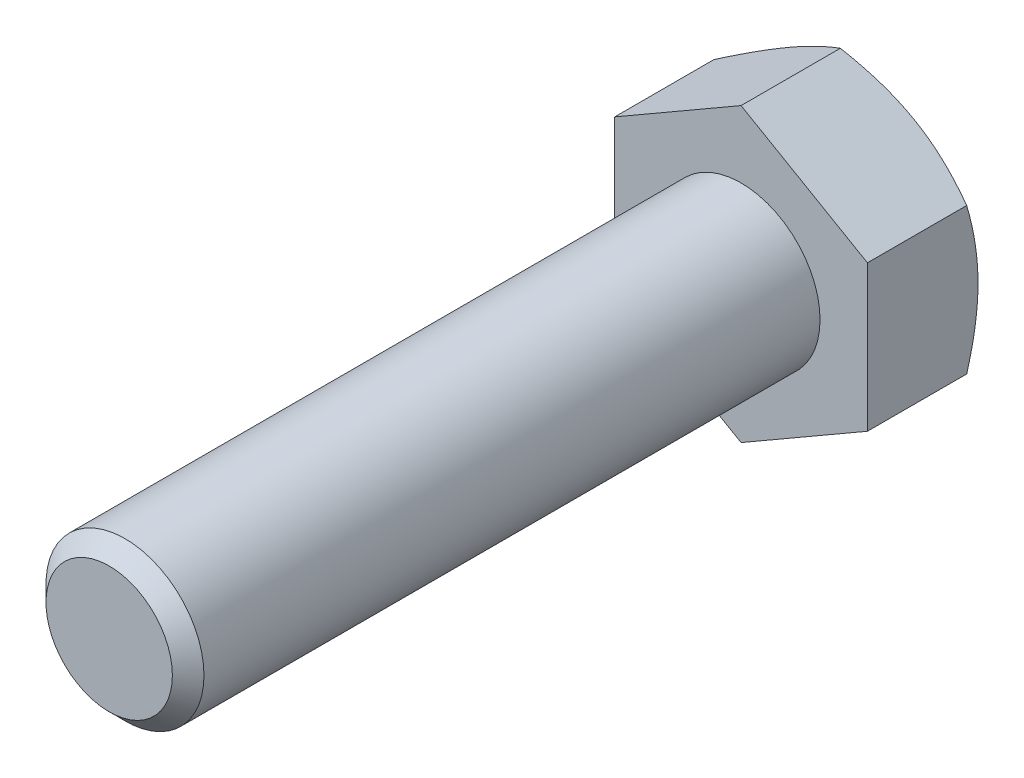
ISO-10303-21;
HEADER;
FILE_DESCRIPTION(('STEP AP214'),'2;1');
FILE_NAME('part.step','',(''),(''),'','','');
FILE_SCHEMA(('AUTOMOTIVE_DESIGN { 1 0 10303 214 1 1 1 1 }'));
ENDSEC;
DATA;
#1=APPLICATION_CONTEXT('core data for automotive mechanical design processes');
#2=APPLICATION_PROTOCOL_DEFINITION('international standard','automotive_design',2000,#1);
#3=PRODUCT_CONTEXT('',#1,'mechanical');
#4=PRODUCT('Part','Part','',(#3));
#5=PRODUCT_RELATED_PRODUCT_CATEGORY('part','',(#4));
#6=PRODUCT_DEFINITION_FORMATION('','',#4);
#7=PRODUCT_DEFINITION_CONTEXT('part definition',#1,'design');
#8=PRODUCT_DEFINITION('design','',#6,#7);
#9=PRODUCT_DEFINITION_SHAPE('','',#8);
#10=(LENGTH_UNIT() NAMED_UNIT(*) SI_UNIT(.MILLI.,.METRE.));
#11=(NAMED_UNIT(*) PLANE_ANGLE_UNIT() SI_UNIT($,.RADIAN.));
#12=(NAMED_UNIT(*) SI_UNIT($,.STERADIAN.) SOLID_ANGLE_UNIT());
#13=UNCERTAINTY_MEASURE_WITH_UNIT(LENGTH_MEASURE(1.E-05),#10,'distance_accuracy_value','');
#14=(GEOMETRIC_REPRESENTATION_CONTEXT(3) GLOBAL_UNCERTAINTY_ASSIGNED_CONTEXT((#13)) GLOBAL_UNIT_ASSIGNED_CONTEXT((#10,
#11,#12)) REPRESENTATION_CONTEXT('',''));
#15=CARTESIAN_POINT('',(0.,0.,0.));
#16=DIRECTION('',(0.,0.,1.));
#17=DIRECTION('',(1.,0.,0.));
#18=AXIS2_PLACEMENT_3D('',#15,#16,#17);
#19=CARTESIAN_POINT('',(0.,0.,20.));
#20=DIRECTION('',(0.,0.,0.999999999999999));
#21=DIRECTION('',(1.,0.,0.));
#22=AXIS2_PLACEMENT_3D('',#19,#20,#21);
#23=PLANE('',#22);
#24=CARTESIAN_POINT('',(0.,0.,20.));
#25=DIRECTION('',(0.,0.,0.999999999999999));
#26=DIRECTION('',(1.,0.,0.));
#27=AXIS2_PLACEMENT_3D('',#24,#25,#26);
#28=CIRCLE('',#27,2.);
#29=CARTESIAN_POINT('',(2.,0.,20.));
#30=VERTEX_POINT('',#29);
#31=EDGE_CURVE('E198',#30,#30,#28,.T.);
#32=ORIENTED_EDGE('',*,*,#31,.T.);
#33=EDGE_LOOP('',(#32));
#34=FACE_BOUND('',#33,.T.);
#35=ADVANCED_FACE('F24',(#34),#23,.T.);
#36=CARTESIAN_POINT('',(0.,0.,0.));
#37=DIRECTION('',(0.,0.,0.999999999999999));
#38=DIRECTION('',(1.,0.,0.));
#39=AXIS2_PLACEMENT_3D('',#36,#37,#38);
#40=CYLINDRICAL_SURFACE('',#39,2.5);
#41=CARTESIAN_POINT('',(0.,0.,19.5));
#42=DIRECTION('',(0.,0.,0.999999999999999));
#43=DIRECTION('',(1.,0.,0.));
#44=AXIS2_PLACEMENT_3D('',#41,#42,#43);
#45=CIRCLE('',#44,2.5);
#46=CARTESIAN_POINT('',(2.50000000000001,0.,19.5));
#47=VERTEX_POINT('',#46);
#48=EDGE_CURVE('E200',#47,#47,#45,.F.);
#49=CARTESIAN_POINT('',(0.,0.,0.));
#50=DIRECTION('',(0.,0.,0.999999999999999));
#51=DIRECTION('',(1.,0.,0.));
#52=AXIS2_PLACEMENT_3D('',#49,#50,#51);
#53=CIRCLE('',#52,2.5);
#54=CARTESIAN_POINT('',(2.5,0.,0.));
#55=VERTEX_POINT('',#54);
#56=EDGE_CURVE('E201',#55,#55,#53,.F.);
#57=CARTESIAN_POINT('',(2.50000000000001,0.,19.5));
#58=CARTESIAN_POINT('',(2.50000000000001,0.,19.296875));
#59=CARTESIAN_POINT('',(2.50000000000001,0.,19.09375));
#60=CARTESIAN_POINT('',(2.50000000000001,0.,18.6875));
#61=CARTESIAN_POINT('',(2.50000000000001,0.,18.484375));
#62=CARTESIAN_POINT('',(2.50000000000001,0.,18.078125));
#63=CARTESIAN_POINT('',(2.50000000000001,0.,17.875));
#64=CARTESIAN_POINT('',(2.50000000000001,0.,17.46875));
#65=CARTESIAN_POINT('',(2.50000000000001,0.,17.265625));
#66=CARTESIAN_POINT('',(2.50000000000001,0.,16.859375));
#67=CARTESIAN_POINT('',(2.50000000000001,0.,16.65625));
#68=CARTESIAN_POINT('',(2.50000000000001,0.,16.25));
#69=CARTESIAN_POINT('',(2.50000000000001,0.,16.046875));
#70=CARTESIAN_POINT('',(2.50000000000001,0.,15.640625));
#71=CARTESIAN_POINT('',(2.50000000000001,0.,15.4375));
#72=CARTESIAN_POINT('',(2.50000000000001,0.,15.03125));
#73=CARTESIAN_POINT('',(2.50000000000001,0.,14.828125));
#74=CARTESIAN_POINT('',(2.50000000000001,0.,14.421875));
#75=CARTESIAN_POINT('',(2.50000000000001,0.,14.21875));
#76=CARTESIAN_POINT('',(2.50000000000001,0.,13.8125));
#77=CARTESIAN_POINT('',(2.50000000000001,0.,13.609375));
#78=CARTESIAN_POINT('',(2.50000000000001,0.,13.203125));
#79=CARTESIAN_POINT('',(2.50000000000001,0.,13.));
#80=CARTESIAN_POINT('',(2.50000000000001,0.,12.59375));
#81=CARTESIAN_POINT('',(2.50000000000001,0.,12.390625));
#82=CARTESIAN_POINT('',(2.50000000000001,0.,11.984375));
#83=CARTESIAN_POINT('',(2.50000000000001,0.,11.78125));
#84=CARTESIAN_POINT('',(2.50000000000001,0.,11.375));
#85=CARTESIAN_POINT('',(2.50000000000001,0.,11.171875));
#86=CARTESIAN_POINT('',(2.50000000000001,0.,10.765625));
#87=CARTESIAN_POINT('',(2.50000000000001,0.,10.5625));
#88=CARTESIAN_POINT('',(2.50000000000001,0.,10.15625));
#89=CARTESIAN_POINT('',(2.50000000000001,0.,9.95312499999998));
#90=CARTESIAN_POINT('',(2.50000000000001,0.,9.54687499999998));
#91=CARTESIAN_POINT('',(2.50000000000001,0.,9.34374999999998));
#92=CARTESIAN_POINT('',(2.50000000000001,0.,8.93749999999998));
#93=CARTESIAN_POINT('',(2.5,0.,8.73437499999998));
#94=CARTESIAN_POINT('',(2.5,0.,8.32812499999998));
#95=CARTESIAN_POINT('',(2.5,0.,8.12499999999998));
#96=CARTESIAN_POINT('',(2.5,0.,7.71874999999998));
#97=CARTESIAN_POINT('',(2.5,0.,7.51562499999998));
#98=CARTESIAN_POINT('',(2.5,0.,7.10937499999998));
#99=CARTESIAN_POINT('',(2.5,0.,6.90624999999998));
#100=CARTESIAN_POINT('',(2.5,0.,6.49999999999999));
#101=CARTESIAN_POINT('',(2.5,0.,6.29687499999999));
#102=CARTESIAN_POINT('',(2.5,0.,5.89062499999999));
#103=CARTESIAN_POINT('',(2.5,0.,5.68749999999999));
#104=CARTESIAN_POINT('',(2.5,0.,5.28124999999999));
#105=CARTESIAN_POINT('',(2.5,0.,5.07812499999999));
#106=CARTESIAN_POINT('',(2.5,0.,4.67187499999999));
#107=CARTESIAN_POINT('',(2.5,0.,4.46874999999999));
#108=CARTESIAN_POINT('',(2.5,0.,4.06249999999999));
#109=CARTESIAN_POINT('',(2.5,0.,3.85937499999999));
#110=CARTESIAN_POINT('',(2.5,0.,3.45312499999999));
#111=CARTESIAN_POINT('',(2.5,0.,3.24999999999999));
#112=CARTESIAN_POINT('',(2.5,0.,2.84374999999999));
#113=CARTESIAN_POINT('',(2.5,0.,2.64062499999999));
#114=CARTESIAN_POINT('',(2.5,0.,2.234375));
#115=CARTESIAN_POINT('',(2.5,0.,2.03125));
#116=CARTESIAN_POINT('',(2.5,0.,1.625));
#117=CARTESIAN_POINT('',(2.5,0.,1.421875));
#118=CARTESIAN_POINT('',(2.5,0.,1.015625));
#119=CARTESIAN_POINT('',(2.5,0.,0.812499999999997));
#120=CARTESIAN_POINT('',(2.5,0.,0.406249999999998));
#121=CARTESIAN_POINT('',(2.5,0.,0.203124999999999));
#122=CARTESIAN_POINT('',(2.5,0.,0.));
#123=B_SPLINE_CURVE_WITH_KNOTS('',3,(#57,#58,#59,#60,#61,#62,#63,#64,#65,#66,#67,#68,#69,#70,
#71,#72,#73,#74,#75,#76,#77,#78,#79,#80,#81,#82,#83,#84,#85,#86,#87,#88,#89,#90,#91,#92,#93,#94,
#95,#96,#97,#98,#99,#100,#101,#102,#103,#104,#105,#106,#107,#108,#109,#110,#111,#112,#113,#114,
#115,#116,#117,#118,#119,#120,#121,#122),.UNSPECIFIED.,.F.,.F.,(4,2,2,2,2,2,2,2,2,2,2,2,2,2,2,2,
2,2,2,2,2,2,2,2,2,2,2,2,2,2,2,2,4),(0.,0.609374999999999,1.21874999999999,1.828125,2.4375,
3.04687499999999,3.65624999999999,4.26562499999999,4.87499999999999,5.48437499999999,
6.09374999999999,6.70312499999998,7.31249999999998,7.92187499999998,8.53124999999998,
9.14062499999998,9.74999999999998,10.359375,10.96875,11.578125,12.1875,12.796875,13.40625,
14.015625,14.625,15.234375,15.84375,16.453125,17.0625,17.671875,18.28125,18.890625,19.5),.UNSPECIFIED.);
#124=EDGE_CURVE('BSEAM189',#47,#55,#123,.T.);
#125=ORIENTED_EDGE('',*,*,#48,.T.);
#126=ORIENTED_EDGE('',*,*,#56,.F.);
#127=ORIENTED_EDGE('',*,*,#124,.T.);
#128=ORIENTED_EDGE('',*,*,#124,.F.);
#129=EDGE_LOOP('',(#125,#127,#126,#128));
#130=FACE_BOUND('',#129,.T.);
#131=ADVANCED_FACE('F189',(#130),#40,.T.);
#132=CARTESIAN_POINT('',(0.,0.,20.));
#133=DIRECTION('',(0.,0.,-0.999999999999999));
#134=DIRECTION('',(-1.,0.,0.));
#135=AXIS2_PLACEMENT_3D('',#132,#133,#134);
#136=CONICAL_SURFACE('',#135,2.,0.785398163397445);
#137=ORIENTED_EDGE('',*,*,#48,.F.);
#138=EDGE_LOOP('',(#137));
#139=FACE_BOUND('',#138,.T.);
#140=ORIENTED_EDGE('',*,*,#31,.F.);
#141=EDGE_LOOP('',(#140));
#142=FACE_BOUND('',#141,.T.);
#143=ADVANCED_FACE('F194',(#139,#142),#136,.T.);
#144=CARTESIAN_POINT('',(0.,4.61880215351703,-3.5));
#145=DIRECTION('',(0.499999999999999,0.866025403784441,0.));
#146=DIRECTION('',(-0.866025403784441,0.499999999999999,0.));
#147=AXIS2_PLACEMENT_3D('',#144,#145,#146);
#148=PLANE('',#147);
#149=CARTESIAN_POINT('',(-0.000200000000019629,4.61891762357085,-3.14266774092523));
#150=CARTESIAN_POINT('',(0.175579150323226,4.51743148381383,-3.2012821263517));
#151=CARTESIAN_POINT('',(0.352875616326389,4.41506932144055,-3.25458967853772));
#152=CARTESIAN_POINT('',(0.710538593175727,4.20857250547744,-3.34763832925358));
#153=CARTESIAN_POINT('',(0.890911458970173,4.10443418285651,-3.38734651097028));
#154=CARTESIAN_POINT('',(1.24942181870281,3.89744813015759,-3.4491577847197));
#155=CARTESIAN_POINT('',(1.42750415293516,3.79463224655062,-3.47167226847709));
#156=CARTESIAN_POINT('',(1.78450671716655,3.58851671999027,-3.4985493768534));
#157=CARTESIAN_POINT('',(1.96342564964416,3.48521782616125,-3.50293425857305));
#158=CARTESIAN_POINT('',(2.29774284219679,3.29219970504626,-3.49380992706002));
#159=CARTESIAN_POINT('',(2.45319115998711,3.20245157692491,-3.48254104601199));
#160=CARTESIAN_POINT('',(2.76307505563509,3.02354002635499,-3.44682600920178));
#161=CARTESIAN_POINT('',(2.91750956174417,2.93437722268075,-3.42236765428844));
#162=CARTESIAN_POINT('',(3.22803232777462,2.75509682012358,-3.36122393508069));
#163=CARTESIAN_POINT('',(3.38408128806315,2.66500191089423,-3.32427939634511));
#164=CARTESIAN_POINT('',(3.69385183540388,2.48615580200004,-3.24042992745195));
#165=CARTESIAN_POINT('',(3.84757739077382,2.39740231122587,-3.19354469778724));
#166=CARTESIAN_POINT('',(4.00020000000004,2.30928560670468,-3.14266774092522));
#167=B_SPLINE_CURVE_WITH_KNOTS('',3,(#149,#150,#151,#152,#153,#154,#155,#156,#157,#158,#159,
#160,#161,#162,#163,#164,#165,#166),.UNSPECIFIED.,.F.,.F.,(4,2,2,2,2,2,2,2,4),(0.,
0.634047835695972,1.26961969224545,1.88946157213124,2.508542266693,3.04757825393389,
3.58711366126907,4.13861653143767,4.68903648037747),.UNSPECIFIED.);
#168=CARTESIAN_POINT('',(0.,4.61880215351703,-3.14273441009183));
#169=VERTEX_POINT('',#168);
#170=CARTESIAN_POINT('',(2.00000000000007,3.46410161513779,-3.49999999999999));
#171=VERTEX_POINT('',#170);
#172=EDGE_CURVE('E234',#169,#171,#167,.T.);
#173=ORIENTED_EDGE('',*,*,#172,.F.);
#174=DIRECTION('',(0.,0.,0.999999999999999));
#175=VECTOR('',#174,1.);
#176=CARTESIAN_POINT('',(0.,4.61880215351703,-3.5));
#177=LINE('',#176,#175);
#178=CARTESIAN_POINT('',(0.,4.61880215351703,0.));
#179=VERTEX_POINT('',#178);
#180=EDGE_CURVE('E208',#169,#179,#177,.T.);
#181=ORIENTED_EDGE('',*,*,#180,.T.);
#182=DIRECTION('',(-0.86602540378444,0.499999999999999,0.));
#183=VECTOR('',#182,1.);
#184=CARTESIAN_POINT('',(0.,4.61880215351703,0.));
#185=LINE('',#184,#183);
#186=CARTESIAN_POINT('',(4.,2.30940107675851,0.));
#187=VERTEX_POINT('',#186);
#188=EDGE_CURVE('E232',#187,#179,#185,.T.);
#189=ORIENTED_EDGE('',*,*,#188,.F.);
#190=DIRECTION('',(0.,0.,0.999999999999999));
#191=VECTOR('',#190,1.);
#192=CARTESIAN_POINT('',(4.,2.30940107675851,-3.49999999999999));
#193=LINE('',#192,#191);
#194=CARTESIAN_POINT('',(4.,2.30940107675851,-3.14273441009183));
#195=VERTEX_POINT('',#194);
#196=EDGE_CURVE('E205',#195,#187,#193,.T.);
#197=ORIENTED_EDGE('',*,*,#196,.F.);
#198=EDGE_CURVE('E164',#171,#195,#167,.T.);
#199=ORIENTED_EDGE('',*,*,#198,.F.);
#200=EDGE_LOOP('',(#173,#181,#189,#197,#199));
#201=FACE_BOUND('',#200,.T.);
#202=ADVANCED_FACE('F174',(#201),#148,.T.);
#203=CARTESIAN_POINT('',(4.00000000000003,-2.3094010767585,-3.49999999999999));
#204=DIRECTION('',(1.,0.,0.));
#205=DIRECTION('',(0.,0.,-0.999999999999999));
#206=AXIS2_PLACEMENT_3D('',#203,#204,#205);
#207=PLANE('',#206);
#208=CARTESIAN_POINT('',(4.,-6.32016209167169,-1.49105074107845));
#209=CARTESIAN_POINT('',(4.00000000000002,-6.14442149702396,-1.57676392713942));
#210=CARTESIAN_POINT('',(4.00000000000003,-5.96828976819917,-1.66168830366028));
#211=CARTESIAN_POINT('',(4.00000000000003,-5.6150364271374,-1.82951794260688));
#212=CARTESIAN_POINT('',(4.00000000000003,-5.43791467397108,-1.91242290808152));
#213=CARTESIAN_POINT('',(4.00000000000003,-5.08161610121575,-2.07616457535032));
#214=CARTESIAN_POINT('',(4.00000000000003,-4.90243340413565,-2.15698853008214));
#215=CARTESIAN_POINT('',(4.00000000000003,-4.54268290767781,-2.31548071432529));
#216=CARTESIAN_POINT('',(4.00000000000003,-4.36211517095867,-2.39314908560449));
#217=CARTESIAN_POINT('',(4.00000000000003,-3.9930904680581,-2.54709429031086));
#218=CARTESIAN_POINT('',(4.00000000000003,-3.80457523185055,-2.62323217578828));
#219=CARTESIAN_POINT('',(4.00000000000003,-3.42538286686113,-2.77002330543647));
#220=CARTESIAN_POINT('',(4.00000000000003,-3.23470550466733,-2.84067595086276));
#221=CARTESIAN_POINT('',(4.00000000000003,-2.85120603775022,-2.97472722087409));
#222=CARTESIAN_POINT('',(4.00000000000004,-2.65838877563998,-3.03813956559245));
#223=CARTESIAN_POINT('',(4.00000000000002,-2.26999073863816,-3.15575322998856));
#224=CARTESIAN_POINT('',(4.,-2.07441081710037,-3.20995732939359));
#225=CARTESIAN_POINT('',(4.,-1.68146389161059,-3.30634238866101));
#226=CARTESIAN_POINT('',(4.00000000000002,-1.48411388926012,-3.34859141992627));
#227=CARTESIAN_POINT('',(4.00000000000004,-1.08684206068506,-3.41875684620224));
#228=CARTESIAN_POINT('',(4.00000000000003,-0.886920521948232,-3.44667482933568));
#229=CARTESIAN_POINT('',(4.00000000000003,-0.48816142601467,-3.48559194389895));
#230=CARTESIAN_POINT('',(4.00000000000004,-0.289346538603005,-3.49681761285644));
#231=CARTESIAN_POINT('',(4.00000000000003,0.108530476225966,-3.50200277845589));
#232=CARTESIAN_POINT('',(4.00000000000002,0.307592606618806,-3.49596206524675));
#233=CARTESIAN_POINT('',(4.00000000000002,0.642130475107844,-3.47173841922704));
#234=CARTESIAN_POINT('',(4.00000000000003,0.777947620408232,-3.45796321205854));
#235=CARTESIAN_POINT('',(4.00000000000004,1.0486572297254,-3.42317125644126));
#236=CARTESIAN_POINT('',(4.00000000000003,1.1835495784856,-3.40215362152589));
#237=CARTESIAN_POINT('',(4.00000000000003,1.58661718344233,-3.32933470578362));
#238=CARTESIAN_POINT('',(4.00000000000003,1.85305348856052,-3.26777809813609));
#239=CARTESIAN_POINT('',(4.00000000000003,2.25169312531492,-3.16013293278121));
#240=CARTESIAN_POINT('',(4.00000000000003,2.38593642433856,-3.12116080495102));
#241=CARTESIAN_POINT('',(4.00000000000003,2.6531212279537,-3.03894486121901));
#242=CARTESIAN_POINT('',(4.00000000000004,2.78606272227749,-2.9957010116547));
#243=CARTESIAN_POINT('',(4.00000000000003,3.05068341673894,-2.90565399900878));
#244=CARTESIAN_POINT('',(4.00000000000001,3.18236294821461,-2.85885180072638));
#245=CARTESIAN_POINT('',(4.00000000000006,3.4446147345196,-2.76226098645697));
#246=CARTESIAN_POINT('',(4.00000000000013,3.57518701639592,-2.71247244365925));
#247=CARTESIAN_POINT('',(4.00000000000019,3.93177798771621,-2.57257226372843));
#248=CARTESIAN_POINT('',(4.00000000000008,4.15680215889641,-2.47992787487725));
#249=CARTESIAN_POINT('',(3.99999999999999,4.60447894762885,-2.28905562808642));
#250=CARTESIAN_POINT('',(4.00000000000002,4.82713127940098,-2.19082710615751));
#251=CARTESIAN_POINT('',(4.00000000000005,5.27061186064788,-1.99013448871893));
#252=CARTESIAN_POINT('',(4.00000000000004,5.49143940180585,-1.88766883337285));
#253=CARTESIAN_POINT('',(4.00000000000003,5.93157734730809,-1.67952247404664));
#254=CARTESIAN_POINT('',(4.00000000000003,6.15088770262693,-1.57384166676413));
#255=CARTESIAN_POINT('',(4.00000000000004,6.58864452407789,-1.35980684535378));
#256=CARTESIAN_POINT('',(4.00000000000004,6.80708897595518,-1.25144872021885));
#257=CARTESIAN_POINT('',(4.00000000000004,7.24298360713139,-1.03274864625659));
#258=CARTESIAN_POINT('',(4.00000000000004,7.4604337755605,-0.922406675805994));
#259=CARTESIAN_POINT('',(4.00000000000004,8.11147090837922,-0.58907300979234));
#260=CARTESIAN_POINT('',(4.00000000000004,8.5438492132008,-0.36372184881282));
#261=CARTESIAN_POINT('',(4.00000000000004,9.35956992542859,0.066462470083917));
#262=CARTESIAN_POINT('',(4.00000000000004,9.74313951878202,0.270866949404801));
#263=CARTESIAN_POINT('',(4.00000000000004,10.5090013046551,0.682114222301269));
#264=CARTESIAN_POINT('',(4.00000000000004,10.891293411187,0.888957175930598));
#265=CARTESIAN_POINT('',(4.00000000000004,11.6535663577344,1.3037178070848));
#266=CARTESIAN_POINT('',(4.00000000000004,12.0335506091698,1.51162922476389));
#267=CARTESIAN_POINT('',(4.00000000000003,12.7927224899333,1.92882752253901));
#268=CARTESIAN_POINT('',(4.00000000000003,13.1719101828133,2.13811428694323));
#269=CARTESIAN_POINT('',(4.,13.5508195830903,2.34790058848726));
#270=B_SPLINE_CURVE_WITH_KNOTS('',3,(#208,#209,#210,#211,#212,#213,#214,#215,#216,#217,#218,
#219,#220,#221,#222,#223,#224,#225,#226,#227,#228,#229,#230,#231,#232,#233,#234,#235,#236,#237,
#238,#239,#240,#241,#242,#243,#244,#245,#246,#247,#248,#249,#250,#251,#252,#253,#254,#255,#256,
#257,#258,#259,#260,#261,#262,#263,#264,#265,#266,#267,#268,#269),.UNSPECIFIED.,.F.,.F.,(4,2,2,
2,2,2,2,2,2,2,2,2,2,2,2,2,2,2,2,2,2,2,2,2,2,2,2,2,2,2,4),(0.,0.586592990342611,1.17327172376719,
1.76295108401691,2.35260392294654,2.96246799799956,3.57239854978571,4.18115341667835,
4.78972418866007,5.39475667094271,5.99972209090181,6.59639988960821,7.19308494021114,
7.60243041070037,8.01182600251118,8.83100524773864,9.2503240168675,9.66964609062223,
10.0888548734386,10.5080533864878,11.2379871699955,11.9680079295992,12.6982998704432,
13.4286153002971,14.1601319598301,14.8916565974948,16.354355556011,17.6582490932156,
18.9622286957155,20.261662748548,21.5609888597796),.UNSPECIFIED.);
#271=CARTESIAN_POINT('',(4.00000000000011,0.,-3.49999999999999));
#272=VERTEX_POINT('',#271);
#273=EDGE_CURVE('E162',#195,#272,#270,.F.);
#274=ORIENTED_EDGE('',*,*,#273,.F.);
#275=ORIENTED_EDGE('',*,*,#196,.T.);
#276=DIRECTION('',(0.,1.,0.));
#277=VECTOR('',#276,1.);
#278=CARTESIAN_POINT('',(4.00000000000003,-2.3094010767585,0.));
#279=LINE('',#278,#277);
#280=CARTESIAN_POINT('',(4.00000000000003,-2.3094010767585,0.));
#281=VERTEX_POINT('',#280);
#282=EDGE_CURVE('E210',#281,#187,#279,.T.);
#283=ORIENTED_EDGE('',*,*,#282,.F.);
#284=DIRECTION('',(0.,0.,0.999999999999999));
#285=VECTOR('',#284,1.);
#286=CARTESIAN_POINT('',(4.00000000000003,-2.3094010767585,-3.49999999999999));
#287=LINE('',#286,#285);
#288=CARTESIAN_POINT('',(4.00000000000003,-2.3094010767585,-3.14273441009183));
#289=VERTEX_POINT('',#288);
#290=EDGE_CURVE('E216',#289,#281,#287,.T.);
#291=ORIENTED_EDGE('',*,*,#290,.F.);
#292=EDGE_CURVE('E157',#272,#289,#270,.F.);
#293=ORIENTED_EDGE('',*,*,#292,.F.);
#294=EDGE_LOOP('',(#274,#275,#283,#291,#293));
#295=FACE_BOUND('',#294,.T.);
#296=ADVANCED_FACE('F170',(#295),#207,.T.);
#297=CARTESIAN_POINT('',(1.2490009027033E-13,-4.61880215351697,-3.5));
#298=DIRECTION('',(0.499999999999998,-0.86602540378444,0.));
#299=DIRECTION('',(0.866025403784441,0.499999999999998,0.));
#300=AXIS2_PLACEMENT_3D('',#297,#298,#299);
#301=PLANE('',#300);
#302=CARTESIAN_POINT('',(4.00020000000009,-2.30928560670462,-3.14266774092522));
#303=CARTESIAN_POINT('',(3.82442084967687,-2.41077174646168,-3.20128212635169));
#304=CARTESIAN_POINT('',(3.64712438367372,-2.51313390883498,-3.2545896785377));
#305=CARTESIAN_POINT('',(3.28946140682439,-2.71963072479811,-3.34763832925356));
#306=CARTESIAN_POINT('',(3.10908854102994,-2.82376904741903,-3.38734651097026));
#307=CARTESIAN_POINT('',(2.7505781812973,-3.03075510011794,-3.4491577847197));
#308=CARTESIAN_POINT('',(2.57249584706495,-3.13357098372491,-3.47167226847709));
#309=CARTESIAN_POINT('',(2.21549328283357,-3.33968651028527,-3.4985493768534));
#310=CARTESIAN_POINT('',(2.03657435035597,-3.44298540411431,-3.50293425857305));
#311=CARTESIAN_POINT('',(1.70225715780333,-3.6360035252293,-3.49380992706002));
#312=CARTESIAN_POINT('',(1.546808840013,-3.72575165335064,-3.482541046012));
#313=CARTESIAN_POINT('',(1.23692494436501,-3.90466320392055,-3.4468260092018));
#314=CARTESIAN_POINT('',(1.08249043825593,-3.99382600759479,-3.42236765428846));
#315=CARTESIAN_POINT('',(0.771967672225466,-4.17310641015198,-3.36122393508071));
#316=CARTESIAN_POINT('',(0.615918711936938,-4.26320131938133,-3.32427939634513));
#317=CARTESIAN_POINT('',(0.306148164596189,-4.44204742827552,-3.24042992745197));
#318=CARTESIAN_POINT('',(0.152422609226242,-4.53080091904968,-3.19354469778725));
#319=CARTESIAN_POINT('',(-0.000199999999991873,-4.61891762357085,-3.14266774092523));
#320=B_SPLINE_CURVE_WITH_KNOTS('',3,(#302,#303,#304,#305,#306,#307,#308,#309,#310,#311,#312,
#313,#314,#315,#316,#317,#318,#319),.UNSPECIFIED.,.F.,.F.,(4,2,2,2,2,2,2,2,4),(0.,
0.634047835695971,1.26961969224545,1.88946157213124,2.508542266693,3.0475782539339,
3.58711366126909,4.13861653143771,4.68903648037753),.UNSPECIFIED.);
#321=CARTESIAN_POINT('',(2.00000000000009,-3.46410161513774,-3.49999999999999));
#322=VERTEX_POINT('',#321);
#323=EDGE_CURVE('E163',#289,#322,#320,.T.);
#324=ORIENTED_EDGE('',*,*,#323,.F.);
#325=ORIENTED_EDGE('',*,*,#290,.T.);
#326=DIRECTION('',(0.86602540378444,0.499999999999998,0.));
#327=VECTOR('',#326,1.);
#328=CARTESIAN_POINT('',(1.2490009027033E-13,-4.61880215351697,0.));
#329=LINE('',#328,#327);
#330=CARTESIAN_POINT('',(1.2490009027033E-13,-4.61880215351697,0.));
#331=VERTEX_POINT('',#330);
#332=EDGE_CURVE('E221',#331,#281,#329,.T.);
#333=ORIENTED_EDGE('',*,*,#332,.F.);
#334=DIRECTION('',(0.,0.,0.999999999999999));
#335=VECTOR('',#334,1.);
#336=CARTESIAN_POINT('',(1.2490009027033E-13,-4.61880215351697,-3.5));
#337=LINE('',#336,#335);
#338=CARTESIAN_POINT('',(1.2490009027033E-13,-4.61880215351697,-3.14273441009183));
#339=VERTEX_POINT('',#338);
#340=EDGE_CURVE('E214',#339,#331,#337,.T.);
#341=ORIENTED_EDGE('',*,*,#340,.F.);
#342=EDGE_CURVE('E151',#322,#339,#320,.T.);
#343=ORIENTED_EDGE('',*,*,#342,.F.);
#344=EDGE_LOOP('',(#324,#325,#333,#341,#343));
#345=FACE_BOUND('',#344,.T.);
#346=ADVANCED_FACE('F173',(#345),#301,.T.);
#347=CARTESIAN_POINT('',(1.2490009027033E-13,-4.61880215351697,-3.5));
#348=DIRECTION('',(-0.500000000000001,-0.866025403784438,0.));
#349=DIRECTION('',(0.866025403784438,-0.500000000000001,0.));
#350=AXIS2_PLACEMENT_3D('',#347,#348,#349);
#351=PLANE('',#350);
#352=CARTESIAN_POINT('',(0.00020000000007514,-4.61891762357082,-3.14266774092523));
#353=CARTESIAN_POINT('',(-0.175579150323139,-4.51743148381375,-3.20128212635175));
#354=CARTESIAN_POINT('',(-0.352875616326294,-4.41506932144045,-3.25458967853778));
#355=CARTESIAN_POINT('',(-0.710538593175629,-4.20857250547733,-3.34763832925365));
#356=CARTESIAN_POINT('',(-0.89091145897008,-4.10443418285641,-3.38734651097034));
#357=CARTESIAN_POINT('',(-1.24942181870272,-3.89744813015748,-3.44915778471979));
#358=CARTESIAN_POINT('',(-1.42750415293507,-3.79463224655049,-3.47167226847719));
#359=CARTESIAN_POINT('',(-1.78450671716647,-3.58851671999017,-3.49854937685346));
#360=CARTESIAN_POINT('',(-1.96342564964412,-3.48521782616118,-3.50293425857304));
#361=CARTESIAN_POINT('',(-2.29774284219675,-3.29219970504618,-3.49380992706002));
#362=CARTESIAN_POINT('',(-2.45319115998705,-3.20245157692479,-3.48254104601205));
#363=CARTESIAN_POINT('',(-2.76307505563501,-3.02354002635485,-3.44682600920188));
#364=CARTESIAN_POINT('',(-2.9175095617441,-2.93437722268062,-3.42236765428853));
#365=CARTESIAN_POINT('',(-3.22803232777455,-2.75509682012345,-3.36122393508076));
#366=CARTESIAN_POINT('',(-3.38408128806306,-2.6650019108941,-3.3242793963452));
#367=CARTESIAN_POINT('',(-3.6938518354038,-2.48615580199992,-3.24042992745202));
#368=CARTESIAN_POINT('',(-3.84757739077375,-2.39740231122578,-3.19354469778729));
#369=CARTESIAN_POINT('',(-4.0002,-2.30928560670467,-3.14266774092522));
#370=B_SPLINE_CURVE_WITH_KNOTS('',3,(#352,#353,#354,#355,#356,#357,#358,#359,#360,#361,#362,
#363,#364,#365,#366,#367,#368,#369),.UNSPECIFIED.,.F.,.F.,(4,2,2,2,2,2,2,2,4),(0.,
0.634047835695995,1.26961969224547,1.88946157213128,2.50854226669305,3.04757825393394,
3.58711366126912,4.13861653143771,4.68903648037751),.UNSPECIFIED.);
#371=CARTESIAN_POINT('',(-2.,-3.46410161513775,-3.49999999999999));
#372=VERTEX_POINT('',#371);
#373=EDGE_CURVE('E253',#339,#372,#370,.T.);
#374=ORIENTED_EDGE('',*,*,#373,.F.);
#375=ORIENTED_EDGE('',*,*,#340,.T.);
#376=DIRECTION('',(0.866025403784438,-0.500000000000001,0.));
#377=VECTOR('',#376,1.);
#378=CARTESIAN_POINT('',(1.2490009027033E-13,-4.61880215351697,0.));
#379=LINE('',#378,#377);
#380=CARTESIAN_POINT('',(-3.99999999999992,-2.30940107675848,0.));
#381=VERTEX_POINT('',#380);
#382=EDGE_CURVE('E224',#381,#331,#379,.T.);
#383=ORIENTED_EDGE('',*,*,#382,.F.);
#384=DIRECTION('',(0.,0.,0.999999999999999));
#385=VECTOR('',#384,1.);
#386=CARTESIAN_POINT('',(-3.99999999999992,-2.30940107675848,-3.49999999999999));
#387=LINE('',#386,#385);
#388=CARTESIAN_POINT('',(-4.,-2.30940107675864,-3.14273441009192));
#389=VERTEX_POINT('',#388);
#390=EDGE_CURVE('E212',#389,#381,#387,.T.);
#391=ORIENTED_EDGE('',*,*,#390,.F.);
#392=EDGE_CURVE('E100',#372,#389,#370,.T.);
#393=ORIENTED_EDGE('',*,*,#392,.F.);
#394=EDGE_LOOP('',(#374,#375,#383,#391,#393));
#395=FACE_BOUND('',#394,.T.);
#396=ADVANCED_FACE('F178',(#395),#351,.T.);
#397=CARTESIAN_POINT('',(-3.99999999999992,-2.30940107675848,-3.49999999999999));
#398=DIRECTION('',(-1.,0.,0.));
#399=DIRECTION('',(0.,0.,0.999999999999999));
#400=AXIS2_PLACEMENT_3D('',#397,#398,#399);
#401=PLANE('',#400);
#402=CARTESIAN_POINT('',(-3.99999999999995,-6.32016209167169,-1.49105074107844));
#403=CARTESIAN_POINT('',(-3.99999999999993,-6.14442149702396,-1.57676392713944));
#404=CARTESIAN_POINT('',(-3.99999999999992,-5.96828976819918,-1.66168830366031));
#405=CARTESIAN_POINT('',(-3.99999999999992,-5.61503642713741,-1.82951794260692));
#406=CARTESIAN_POINT('',(-3.99999999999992,-5.43791467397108,-1.91242290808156));
#407=CARTESIAN_POINT('',(-3.99999999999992,-5.08161610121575,-2.07616457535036));
#408=CARTESIAN_POINT('',(-3.99999999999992,-4.90243340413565,-2.15698853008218));
#409=CARTESIAN_POINT('',(-3.99999999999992,-4.54268290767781,-2.31548071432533));
#410=CARTESIAN_POINT('',(-3.99999999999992,-4.36211517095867,-2.39314908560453));
#411=CARTESIAN_POINT('',(-3.99999999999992,-3.9930904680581,-2.5470942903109));
#412=CARTESIAN_POINT('',(-3.99999999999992,-3.80457523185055,-2.62323217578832));
#413=CARTESIAN_POINT('',(-3.99999999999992,-3.42538286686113,-2.77002330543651));
#414=CARTESIAN_POINT('',(-3.99999999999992,-3.23470550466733,-2.84067595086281));
#415=CARTESIAN_POINT('',(-3.99999999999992,-2.85120603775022,-2.97472722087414));
#416=CARTESIAN_POINT('',(-3.99999999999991,-2.65838877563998,-3.03813956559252));
#417=CARTESIAN_POINT('',(-3.99999999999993,-2.26999073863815,-3.15575322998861));
#418=CARTESIAN_POINT('',(-3.99999999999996,-2.07441081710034,-3.20995732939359));
#419=CARTESIAN_POINT('',(-3.99999999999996,-1.68146389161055,-3.30634238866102));
#420=CARTESIAN_POINT('',(-3.99999999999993,-1.48411388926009,-3.34859141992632));
#421=CARTESIAN_POINT('',(-3.99999999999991,-1.08684206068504,-3.41875684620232));
#422=CARTESIAN_POINT('',(-3.99999999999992,-0.886920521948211,-3.44667482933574));
#423=CARTESIAN_POINT('',(-3.99999999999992,-0.488161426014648,-3.48559194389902));
#424=CARTESIAN_POINT('',(-3.99999999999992,-0.289346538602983,-3.49681761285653));
#425=CARTESIAN_POINT('',(-3.99999999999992,0.108530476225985,-3.50200277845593));
#426=CARTESIAN_POINT('',(-3.99999999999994,0.307592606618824,-3.49596206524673));
#427=CARTESIAN_POINT('',(-3.99999999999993,0.642130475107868,-3.47173841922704));
#428=CARTESIAN_POINT('',(-3.99999999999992,0.777947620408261,-3.45796321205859));
#429=CARTESIAN_POINT('',(-3.99999999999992,1.04865722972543,-3.42317125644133));
#430=CARTESIAN_POINT('',(-3.99999999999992,1.18354957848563,-3.40215362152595));
#431=CARTESIAN_POINT('',(-3.99999999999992,1.58661718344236,-3.32933470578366));
#432=CARTESIAN_POINT('',(-3.99999999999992,1.85305348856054,-3.26777809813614));
#433=CARTESIAN_POINT('',(-3.99999999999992,2.25169312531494,-3.16013293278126));
#434=CARTESIAN_POINT('',(-3.99999999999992,2.38593642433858,-3.12116080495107));
#435=CARTESIAN_POINT('',(-3.99999999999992,2.65312122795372,-3.03894486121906));
#436=CARTESIAN_POINT('',(-3.99999999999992,2.78606272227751,-2.99570101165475));
#437=CARTESIAN_POINT('',(-3.99999999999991,3.05068341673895,-2.90565399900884));
#438=CARTESIAN_POINT('',(-3.9999999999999,3.18236294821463,-2.85885180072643));
#439=CARTESIAN_POINT('',(-3.99999999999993,3.44461473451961,-2.76226098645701));
#440=CARTESIAN_POINT('',(-3.99999999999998,3.57518701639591,-2.71247244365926));
#441=CARTESIAN_POINT('',(-4.00000000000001,3.9317779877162,-2.57257226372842));
#442=CARTESIAN_POINT('',(-3.99999999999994,4.15680215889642,-2.47992787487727));
#443=CARTESIAN_POINT('',(-3.99999999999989,4.60447894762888,-2.28905562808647));
#444=CARTESIAN_POINT('',(-3.99999999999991,4.827131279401,-2.19082710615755));
#445=CARTESIAN_POINT('',(-3.99999999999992,5.27061186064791,-1.99013448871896));
#446=CARTESIAN_POINT('',(-3.99999999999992,5.49143940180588,-1.88766883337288));
#447=CARTESIAN_POINT('',(-3.99999999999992,5.93157734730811,-1.67952247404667));
#448=CARTESIAN_POINT('',(-3.99999999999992,6.15088770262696,-1.57384166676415));
#449=CARTESIAN_POINT('',(-3.99999999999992,6.58864452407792,-1.3598068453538));
#450=CARTESIAN_POINT('',(-3.99999999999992,6.80708897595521,-1.25144872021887));
#451=CARTESIAN_POINT('',(-3.99999999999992,7.24298360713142,-1.03274864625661));
#452=CARTESIAN_POINT('',(-3.99999999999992,7.46043377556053,-0.92240667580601));
#453=CARTESIAN_POINT('',(-3.99999999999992,8.11147090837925,-0.589073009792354));
#454=CARTESIAN_POINT('',(-3.99999999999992,8.54384921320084,-0.363721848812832));
#455=CARTESIAN_POINT('',(-3.99999999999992,9.35956992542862,0.0664624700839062));
#456=CARTESIAN_POINT('',(-3.99999999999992,9.74313951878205,0.270866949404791));
#457=CARTESIAN_POINT('',(-3.99999999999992,10.5090013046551,0.682114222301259));
#458=CARTESIAN_POINT('',(-3.99999999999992,10.891293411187,0.888957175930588));
#459=CARTESIAN_POINT('',(-3.99999999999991,11.6535663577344,1.30371780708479));
#460=CARTESIAN_POINT('',(-3.99999999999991,12.0335506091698,1.51162922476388));
#461=CARTESIAN_POINT('',(-3.99999999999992,12.7927224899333,1.928827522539));
#462=CARTESIAN_POINT('',(-3.99999999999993,13.1719101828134,2.13811428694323));
#463=CARTESIAN_POINT('',(-3.99999999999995,13.5508195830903,2.34790058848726));
#464=B_SPLINE_CURVE_WITH_KNOTS('',3,(#402,#403,#404,#405,#406,#407,#408,#409,#410,#411,#412,
#413,#414,#415,#416,#417,#418,#419,#420,#421,#422,#423,#424,#425,#426,#427,#428,#429,#430,#431,
#432,#433,#434,#435,#436,#437,#438,#439,#440,#441,#442,#443,#444,#445,#446,#447,#448,#449,#450,
#451,#452,#453,#454,#455,#456,#457,#458,#459,#460,#461,#462,#463),.UNSPECIFIED.,.F.,.F.,(4,2,2,
2,2,2,2,2,2,2,2,2,2,2,2,2,2,2,2,2,2,2,2,2,2,2,2,2,2,2,4),(0.,0.586592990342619,1.1732717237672,
1.76295108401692,2.35260392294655,2.96246799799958,3.57239854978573,4.18115341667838,
4.7897241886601,5.39475667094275,5.99972209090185,6.59639988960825,7.19308494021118,
7.60243041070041,8.01182600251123,8.83100524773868,9.25032401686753,9.66964609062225,
10.0888548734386,10.5080533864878,11.2379871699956,11.9680079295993,12.6982998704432,
13.4286153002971,14.1601319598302,14.8916565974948,16.354355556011,17.6582490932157,
18.9622286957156,20.261662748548,21.5609888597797),.UNSPECIFIED.);
#465=CARTESIAN_POINT('',(-3.99999999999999,0.,-3.49999999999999));
#466=VERTEX_POINT('',#465);
#467=EDGE_CURVE('E95',#389,#466,#464,.T.);
#468=ORIENTED_EDGE('',*,*,#467,.F.);
#469=ORIENTED_EDGE('',*,*,#390,.T.);
#470=DIRECTION('',(0.,-1.,0.));
#471=VECTOR('',#470,1.);
#472=CARTESIAN_POINT('',(-3.99999999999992,-2.30940107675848,0.));
#473=LINE('',#472,#471);
#474=CARTESIAN_POINT('',(-3.99999999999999,2.30940107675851,0.));
#475=VERTEX_POINT('',#474);
#476=EDGE_CURVE('E227',#475,#381,#473,.T.);
#477=ORIENTED_EDGE('',*,*,#476,.F.);
#478=DIRECTION('',(0.,0.,0.999999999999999));
#479=VECTOR('',#478,1.);
#480=CARTESIAN_POINT('',(-3.99999999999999,2.30940107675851,-3.49999999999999));
#481=LINE('',#480,#479);
#482=CARTESIAN_POINT('',(-3.99999999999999,2.30940107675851,-3.14273441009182));
#483=VERTEX_POINT('',#482);
#484=EDGE_CURVE('E121',#483,#475,#481,.T.);
#485=ORIENTED_EDGE('',*,*,#484,.F.);
#486=EDGE_CURVE('E104',#466,#483,#464,.T.);
#487=ORIENTED_EDGE('',*,*,#486,.F.);
#488=EDGE_LOOP('',(#468,#469,#477,#485,#487));
#489=FACE_BOUND('',#488,.T.);
#490=ADVANCED_FACE('F119',(#489),#401,.T.);
#491=CARTESIAN_POINT('',(-3.99999999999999,2.30940107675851,-3.49999999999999));
#492=DIRECTION('',(-0.500000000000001,0.866025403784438,0.));
#493=DIRECTION('',(-0.866025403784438,-0.500000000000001,0.));
#494=AXIS2_PLACEMENT_3D('',#491,#492,#493);
#495=PLANE('',#494);
#496=CARTESIAN_POINT('',(-4.00019999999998,2.30928560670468,-3.14266774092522));
#497=CARTESIAN_POINT('',(-3.82442084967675,2.41077174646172,-3.20128212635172));
#498=CARTESIAN_POINT('',(-3.64712438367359,2.51313390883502,-3.25458967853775));
#499=CARTESIAN_POINT('',(-3.28946140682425,2.71963072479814,-3.34763832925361));
#500=CARTESIAN_POINT('',(-3.1090885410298,2.82376904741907,-3.38734651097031));
#501=CARTESIAN_POINT('',(-2.75057818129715,3.03075510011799,-3.44915778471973));
#502=CARTESIAN_POINT('',(-2.57249584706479,3.13357098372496,-3.47167226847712));
#503=CARTESIAN_POINT('',(-2.21549328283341,3.33968651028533,-3.49854937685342));
#504=CARTESIAN_POINT('',(-2.03657435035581,3.44298540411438,-3.50293425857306));
#505=CARTESIAN_POINT('',(-1.70225715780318,3.63600352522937,-3.49380992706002));
#506=CARTESIAN_POINT('',(-1.54680884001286,3.72575165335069,-3.482541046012));
#507=CARTESIAN_POINT('',(-1.23692494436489,3.90466320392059,-3.4468260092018));
#508=CARTESIAN_POINT('',(-1.08249043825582,3.99382600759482,-3.42236765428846));
#509=CARTESIAN_POINT('',(-0.771967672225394,4.17310641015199,-3.3612239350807));
#510=CARTESIAN_POINT('',(-0.615918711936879,4.26320131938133,-3.32427939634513));
#511=CARTESIAN_POINT('',(-0.306148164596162,4.44204742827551,-3.24042992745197));
#512=CARTESIAN_POINT('',(-0.152422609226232,4.53080091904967,-3.19354469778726));
#513=CARTESIAN_POINT('',(0.000199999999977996,4.61891762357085,-3.14266774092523));
#514=B_SPLINE_CURVE_WITH_KNOTS('',3,(#496,#497,#498,#499,#500,#501,#502,#503,#504,#505,#506,
#507,#508,#509,#510,#511,#512,#513),.UNSPECIFIED.,.F.,.F.,(4,2,2,2,2,2,2,2,4),(0.,
0.63404783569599,1.26961969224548,1.88946157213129,2.50854226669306,3.04757825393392,
3.58711366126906,4.13861653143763,4.6890364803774),.UNSPECIFIED.);
#515=CARTESIAN_POINT('',(-1.9999999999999,3.46410161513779,-3.5));
#516=VERTEX_POINT('',#515);
#517=EDGE_CURVE('E110',#483,#516,#514,.T.);
#518=ORIENTED_EDGE('',*,*,#517,.F.);
#519=ORIENTED_EDGE('',*,*,#484,.T.);
#520=DIRECTION('',(-0.866025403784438,-0.500000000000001,0.));
#521=VECTOR('',#520,1.);
#522=CARTESIAN_POINT('',(-3.99999999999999,2.30940107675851,0.));
#523=LINE('',#522,#521);
#524=EDGE_CURVE('E230',#179,#475,#523,.T.);
#525=ORIENTED_EDGE('',*,*,#524,.F.);
#526=ORIENTED_EDGE('',*,*,#180,.F.);
#527=EDGE_CURVE('E112',#516,#169,#514,.T.);
#528=ORIENTED_EDGE('',*,*,#527,.F.);
#529=EDGE_LOOP('',(#518,#519,#525,#526,#528));
#530=FACE_BOUND('',#529,.T.);
#531=ADVANCED_FACE('F186',(#530),#495,.T.);
#532=CARTESIAN_POINT('',(4.,2.30940107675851,0.));
#533=DIRECTION('',(0.,0.,0.999999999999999));
#534=DIRECTION('',(1.,0.,0.));
#535=AXIS2_PLACEMENT_3D('',#532,#533,#534);
#536=PLANE('',#535);
#537=ORIENTED_EDGE('',*,*,#56,.T.);
#538=EDGE_LOOP('',(#537));
#539=FACE_BOUND('',#538,.T.);
#540=ORIENTED_EDGE('',*,*,#188,.T.);
#541=ORIENTED_EDGE('',*,*,#524,.T.);
#542=ORIENTED_EDGE('',*,*,#476,.T.);
#543=ORIENTED_EDGE('',*,*,#382,.T.);
#544=ORIENTED_EDGE('',*,*,#332,.T.);
#545=ORIENTED_EDGE('',*,*,#282,.T.);
#546=EDGE_LOOP('',(#540,#541,#542,#543,#544,#545));
#547=FACE_BOUND('',#546,.T.);
#548=ADVANCED_FACE('F143',(#539,#547),#536,.T.);
#549=CARTESIAN_POINT('',(0.,0.,0.));
#550=DIRECTION('',(0.,0.,0.999999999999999));
#551=DIRECTION('',(1.,0.,0.));
#552=AXIS2_PLACEMENT_3D('',#549,#550,#551);
#553=CONICAL_SURFACE('',#552,10.062177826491,1.0471975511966);
#554=ORIENTED_EDGE('',*,*,#198,.T.);
#555=ORIENTED_EDGE('',*,*,#273,.T.);
#556=CARTESIAN_POINT('',(0.,0.,-3.5));
#557=DIRECTION('',(0.,0.,0.999999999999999));
#558=DIRECTION('',(1.,0.,0.));
#559=AXIS2_PLACEMENT_3D('',#556,#557,#558);
#560=CIRCLE('',#559,4.);
#561=EDGE_CURVE('E27',#171,#272,#560,.F.);
#562=ORIENTED_EDGE('',*,*,#561,.F.);
#563=EDGE_LOOP('',(#554,#555,#562));
#564=FACE_BOUND('',#563,.T.);
#565=ADVANCED_FACE('F243',(#564),#553,.T.);
#566=ORIENTED_EDGE('',*,*,#172,.T.);
#567=EDGE_CURVE('E117',#516,#171,#560,.F.);
#568=ORIENTED_EDGE('',*,*,#567,.F.);
#569=ORIENTED_EDGE('',*,*,#527,.T.);
#570=EDGE_LOOP('',(#566,#568,#569));
#571=FACE_BOUND('',#570,.T.);
#572=ADVANCED_FACE('F142',(#571),#553,.T.);
#573=ORIENTED_EDGE('',*,*,#486,.T.);
#574=ORIENTED_EDGE('',*,*,#517,.T.);
#575=CARTESIAN_POINT('',(0.,0.,-3.5));
#576=DIRECTION('',(0.,0.,-0.999999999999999));
#577=DIRECTION('',(-1.,0.,0.));
#578=AXIS2_PLACEMENT_3D('',#575,#576,#577);
#579=CIRCLE('',#578,4.);
#580=EDGE_CURVE('E45',#466,#516,#579,.T.);
#581=ORIENTED_EDGE('',*,*,#580,.F.);
#582=EDGE_LOOP('',(#573,#574,#581));
#583=FACE_BOUND('',#582,.T.);
#584=ADVANCED_FACE('F108',(#583),#553,.T.);
#585=ORIENTED_EDGE('',*,*,#392,.T.);
#586=ORIENTED_EDGE('',*,*,#467,.T.);
#587=EDGE_CURVE('E97',#372,#466,#560,.F.);
#588=ORIENTED_EDGE('',*,*,#587,.F.);
#589=EDGE_LOOP('',(#585,#586,#588));
#590=FACE_BOUND('',#589,.T.);
#591=ADVANCED_FACE('F96',(#590),#553,.T.);
#592=ORIENTED_EDGE('',*,*,#342,.T.);
#593=ORIENTED_EDGE('',*,*,#373,.T.);
#594=EDGE_CURVE('E32',#322,#372,#560,.F.);
#595=ORIENTED_EDGE('',*,*,#594,.F.);
#596=EDGE_LOOP('',(#592,#593,#595));
#597=FACE_BOUND('',#596,.T.);
#598=ADVANCED_FACE('F255',(#597),#553,.T.);
#599=ORIENTED_EDGE('',*,*,#292,.T.);
#600=ORIENTED_EDGE('',*,*,#323,.T.);
#601=EDGE_CURVE('E11',#272,#322,#560,.F.);
#602=ORIENTED_EDGE('',*,*,#601,.F.);
#603=EDGE_LOOP('',(#599,#600,#602));
#604=FACE_BOUND('',#603,.T.);
#605=ADVANCED_FACE('F250',(#604),#553,.T.);
#606=CARTESIAN_POINT('',(4.,2.30940107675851,-3.49999999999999));
#607=DIRECTION('',(0.,0.,0.999999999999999));
#608=DIRECTION('',(1.,0.,0.));
#609=AXIS2_PLACEMENT_3D('',#606,#607,#608);
#610=PLANE('',#609);
#611=ORIENTED_EDGE('',*,*,#561,.T.);
#612=ORIENTED_EDGE('',*,*,#601,.T.);
#613=ORIENTED_EDGE('',*,*,#594,.T.);
#614=ORIENTED_EDGE('',*,*,#587,.T.);
#615=ORIENTED_EDGE('',*,*,#580,.T.);
#616=ORIENTED_EDGE('',*,*,#567,.T.);
#617=EDGE_LOOP('',(#611,#612,#613,#614,#615,#616));
#618=FACE_BOUND('',#617,.T.);
#619=ADVANCED_FACE('F115',(#618),#610,.F.);
#620=CLOSED_SHELL('',(#35,#131,#143,#202,#296,#346,#396,#490,#531,#548,#565,#572,#584,#591,#598,
#605,#619));
#621=MANIFOLD_SOLID_BREP('B2',#620);
#622=ADVANCED_BREP_SHAPE_REPRESENTATION('',(#18,#621),#14);
#623=SHAPE_DEFINITION_REPRESENTATION(#9,#622);
ENDSEC;
END-ISO-10303-21;
